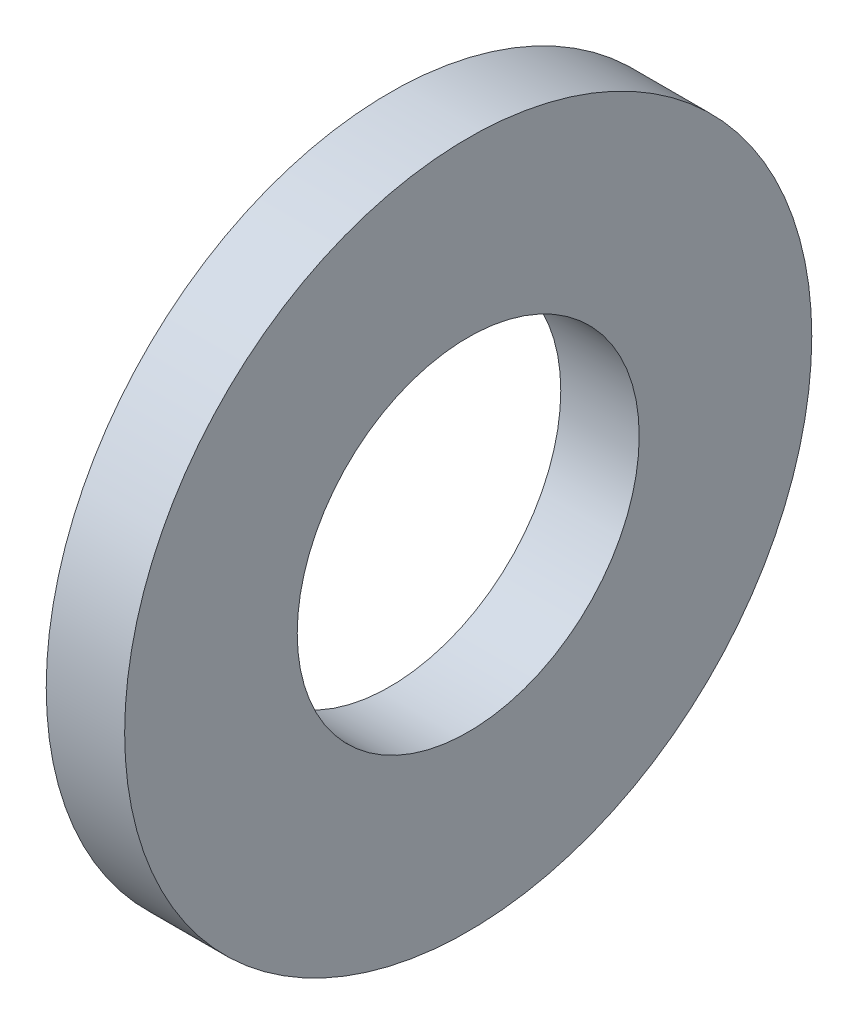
from build123d import *

# Parameters (mm, degrees)
SKETCH1_W = 0.635
SKETCH1_H = 1.397


with BuildPart() as part:
    # Sketch1 → Base-Revolve (revolve)
    with BuildSketch(Plane.XY, mode=Mode.PRIVATE) as base_revolve_sk:
        with Locations((-0.3175, 2.0828)):
            Rectangle(SKETCH1_W, SKETCH1_H)
    revolve(base_revolve_sk.sketch.rotate(Axis((-34.925, 0, 0), (1, 0, 0)), 90), axis=Axis((-34.925, 0, 0), (1, 0, 0)))


solid = part.part
